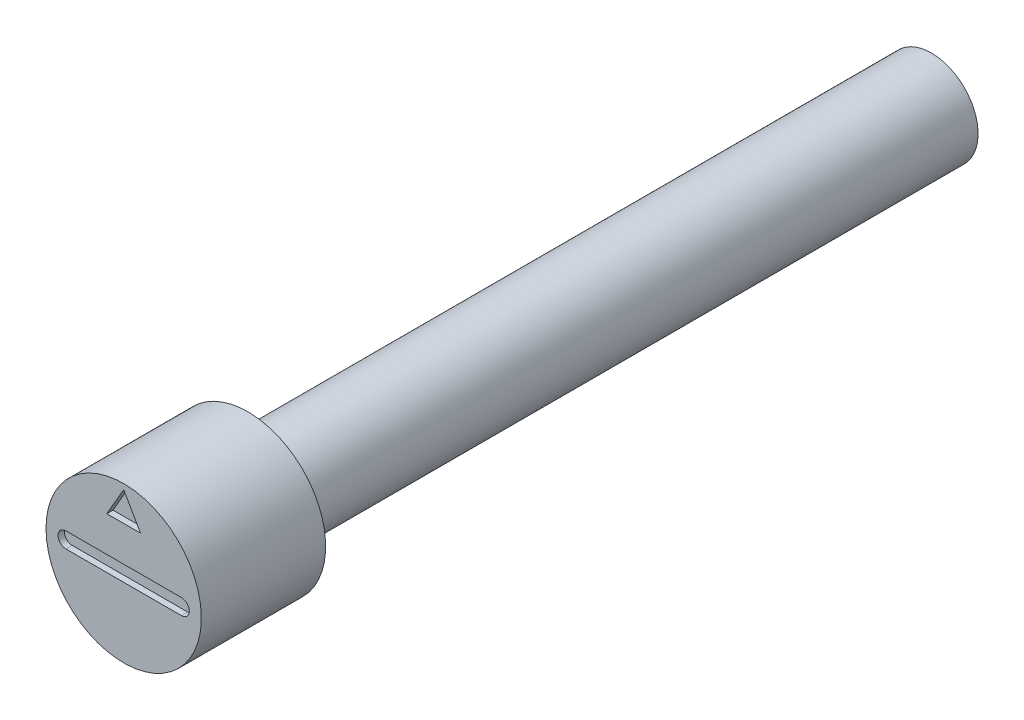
ISO-10303-21;
HEADER;
FILE_DESCRIPTION(('STEP AP214'),'2;1');
FILE_NAME('part.step','',(''),(''),'','','');
FILE_SCHEMA(('AUTOMOTIVE_DESIGN { 1 0 10303 214 1 1 1 1 }'));
ENDSEC;
DATA;
#1=APPLICATION_CONTEXT('core data for automotive mechanical design processes');
#2=APPLICATION_PROTOCOL_DEFINITION('international standard','automotive_design',2000,#1);
#3=PRODUCT_CONTEXT('',#1,'mechanical');
#4=PRODUCT('Part','Part','',(#3));
#5=PRODUCT_RELATED_PRODUCT_CATEGORY('part','',(#4));
#6=PRODUCT_DEFINITION_FORMATION('','',#4);
#7=PRODUCT_DEFINITION_CONTEXT('part definition',#1,'design');
#8=PRODUCT_DEFINITION('design','',#6,#7);
#9=PRODUCT_DEFINITION_SHAPE('','',#8);
#10=(LENGTH_UNIT() NAMED_UNIT(*) SI_UNIT(.MILLI.,.METRE.));
#11=(NAMED_UNIT(*) PLANE_ANGLE_UNIT() SI_UNIT($,.RADIAN.));
#12=(NAMED_UNIT(*) SI_UNIT($,.STERADIAN.) SOLID_ANGLE_UNIT());
#13=UNCERTAINTY_MEASURE_WITH_UNIT(LENGTH_MEASURE(1.E-05),#10,'distance_accuracy_value','');
#14=(GEOMETRIC_REPRESENTATION_CONTEXT(3) GLOBAL_UNCERTAINTY_ASSIGNED_CONTEXT((#13)) GLOBAL_UNIT_ASSIGNED_CONTEXT((#10,
#11,#12)) REPRESENTATION_CONTEXT('',''));
#15=CARTESIAN_POINT('',(0.,0.,0.));
#16=DIRECTION('',(0.,0.,1.));
#17=DIRECTION('',(1.,0.,0.));
#18=AXIS2_PLACEMENT_3D('',#15,#16,#17);
#19=CARTESIAN_POINT('',(0.62499875,0.,0.));
#20=DIRECTION('',(0.,0.,1.));
#21=DIRECTION('',(1.,0.,0.));
#22=AXIS2_PLACEMENT_3D('',#19,#20,#21);
#23=PLANE('',#22);
#24=CARTESIAN_POINT('',(-0.93,0.,0.));
#25=DIRECTION('',(0.,0.,1.));
#26=DIRECTION('',(1.,0.,0.));
#27=AXIS2_PLACEMENT_3D('',#24,#25,#26);
#28=CIRCLE('',#27,0.126);
#29=CARTESIAN_POINT('',(-0.93,0.126,0.));
#30=VERTEX_POINT('',#29);
#31=CARTESIAN_POINT('',(-0.93,-0.126,0.));
#32=VERTEX_POINT('',#31);
#33=EDGE_CURVE('E52',#30,#32,#28,.T.);
#34=ORIENTED_EDGE('',*,*,#33,.F.);
#35=DIRECTION('',(-1.,0.,0.));
#36=VECTOR('',#35,1.);
#37=CARTESIAN_POINT('',(-0.93,0.126,0.));
#38=LINE('',#37,#36);
#39=CARTESIAN_POINT('',(0.93,0.126,0.));
#40=VERTEX_POINT('',#39);
#41=EDGE_CURVE('E116',#40,#30,#38,.T.);
#42=ORIENTED_EDGE('',*,*,#41,.F.);
#43=CARTESIAN_POINT('',(0.93,0.,0.));
#44=DIRECTION('',(0.,0.,1.));
#45=DIRECTION('',(1.,0.,0.));
#46=AXIS2_PLACEMENT_3D('',#43,#44,#45);
#47=CIRCLE('',#46,0.126);
#48=CARTESIAN_POINT('',(0.93,-0.126,0.));
#49=VERTEX_POINT('',#48);
#50=EDGE_CURVE('E119',#49,#40,#47,.T.);
#51=ORIENTED_EDGE('',*,*,#50,.F.);
#52=DIRECTION('',(1.,0.,0.));
#53=VECTOR('',#52,1.);
#54=CARTESIAN_POINT('',(-0.93,-0.126,0.));
#55=LINE('',#54,#53);
#56=EDGE_CURVE('E125',#32,#49,#55,.T.);
#57=ORIENTED_EDGE('',*,*,#56,.F.);
#58=EDGE_LOOP('',(#34,#42,#51,#57));
#59=FACE_BOUND('',#58,.T.);
#60=DIRECTION('',(-0.499999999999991,0.866025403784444,0.));
#61=VECTOR('',#60,1.);
#62=CARTESIAN_POINT('',(0.271499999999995,0.6939,0.));
#63=LINE('',#62,#61);
#64=CARTESIAN_POINT('',(0.271499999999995,0.6939,0.));
#65=VERTEX_POINT('',#64);
#66=CARTESIAN_POINT('',(0.,1.16415179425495,0.));
#67=VERTEX_POINT('',#66);
#68=EDGE_CURVE('E60',#65,#67,#63,.T.);
#69=ORIENTED_EDGE('',*,*,#68,.F.);
#70=DIRECTION('',(1.,0.,0.));
#71=VECTOR('',#70,1.);
#72=CARTESIAN_POINT('',(-0.271500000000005,0.6939,0.));
#73=LINE('',#72,#71);
#74=CARTESIAN_POINT('',(-0.271500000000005,0.6939,0.));
#75=VERTEX_POINT('',#74);
#76=EDGE_CURVE('E138',#75,#65,#73,.T.);
#77=ORIENTED_EDGE('',*,*,#76,.F.);
#78=DIRECTION('',(-0.500000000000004,-0.866025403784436,0.));
#79=VECTOR('',#78,1.);
#80=CARTESIAN_POINT('',(0.,1.16415179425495,0.));
#81=LINE('',#80,#79);
#82=EDGE_CURVE('E146',#67,#75,#81,.T.);
#83=ORIENTED_EDGE('',*,*,#82,.F.);
#84=EDGE_LOOP('',(#69,#77,#83));
#85=FACE_BOUND('',#84,.T.);
#86=CARTESIAN_POINT('',(0.,0.,0.));
#87=DIRECTION('',(0.,0.,-1.));
#88=DIRECTION('',(-1.,0.,0.));
#89=AXIS2_PLACEMENT_3D('',#86,#87,#88);
#90=CIRCLE('',#89,1.2499975);
#91=CARTESIAN_POINT('',(-1.2499975,0.,0.));
#92=VERTEX_POINT('',#91);
#93=EDGE_CURVE('E39',#92,#92,#90,.T.);
#94=ORIENTED_EDGE('',*,*,#93,.F.);
#95=EDGE_LOOP('',(#94));
#96=FACE_BOUND('',#95,.T.);
#97=ADVANCED_FACE('F36',(#59,#85,#96),#23,.T.);
#98=CARTESIAN_POINT('',(0.,0.,-0.999998));
#99=DIRECTION('',(0.,0.,-1.));
#100=DIRECTION('',(-1.,0.,0.));
#101=AXIS2_PLACEMENT_3D('',#98,#99,#100);
#102=CYLINDRICAL_SURFACE('',#101,1.2499975);
#103=ORIENTED_EDGE('',*,*,#93,.T.);
#104=EDGE_LOOP('',(#103));
#105=FACE_BOUND('',#104,.T.);
#106=CARTESIAN_POINT('',(0.,0.,-1.999996));
#107=DIRECTION('',(0.,0.,-1.));
#108=DIRECTION('',(-1.,0.,0.));
#109=AXIS2_PLACEMENT_3D('',#106,#107,#108);
#110=CIRCLE('',#109,1.2499975);
#111=CARTESIAN_POINT('',(-1.2499975,0.,-1.999996));
#112=VERTEX_POINT('',#111);
#113=EDGE_CURVE('E157',#112,#112,#110,.T.);
#114=ORIENTED_EDGE('',*,*,#113,.F.);
#115=EDGE_LOOP('',(#114));
#116=FACE_BOUND('',#115,.T.);
#117=ADVANCED_FACE('F164',(#105,#116),#102,.T.);
#118=CARTESIAN_POINT('',(0.999998,0.,-1.999996));
#119=DIRECTION('',(0.,0.,-1.));
#120=DIRECTION('',(-1.,0.,0.));
#121=AXIS2_PLACEMENT_3D('',#118,#119,#120);
#122=PLANE('',#121);
#123=CARTESIAN_POINT('',(0.,0.,-1.999996));
#124=DIRECTION('',(0.,0.,-1.));
#125=DIRECTION('',(-1.,0.,0.));
#126=AXIS2_PLACEMENT_3D('',#123,#124,#125);
#127=CIRCLE('',#126,0.7499985);
#128=CARTESIAN_POINT('',(-0.749998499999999,0.,-1.999996));
#129=VERTEX_POINT('',#128);
#130=EDGE_CURVE('E44',#129,#129,#127,.T.);
#131=ORIENTED_EDGE('',*,*,#130,.F.);
#132=EDGE_LOOP('',(#131));
#133=FACE_BOUND('',#132,.T.);
#134=ORIENTED_EDGE('',*,*,#113,.T.);
#135=EDGE_LOOP('',(#134));
#136=FACE_BOUND('',#135,.T.);
#137=ADVANCED_FACE('F173',(#133,#136),#122,.T.);
#138=CARTESIAN_POINT('',(0.37499925,0.,-12.999974));
#139=DIRECTION('',(0.,0.,-1.));
#140=DIRECTION('',(-1.,0.,0.));
#141=AXIS2_PLACEMENT_3D('',#138,#139,#140);
#142=PLANE('',#141);
#143=CARTESIAN_POINT('',(0.,0.,-12.999974));
#144=DIRECTION('',(0.,0.,-1.));
#145=DIRECTION('',(-1.,0.,0.));
#146=AXIS2_PLACEMENT_3D('',#143,#144,#145);
#147=CIRCLE('',#146,0.7499985);
#148=CARTESIAN_POINT('',(-0.749998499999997,0.,-12.999974));
#149=VERTEX_POINT('',#148);
#150=EDGE_CURVE('E11',#149,#149,#147,.F.);
#151=ORIENTED_EDGE('',*,*,#150,.F.);
#152=EDGE_LOOP('',(#151));
#153=FACE_BOUND('',#152,.T.);
#154=ADVANCED_FACE('F180',(#153),#142,.T.);
#155=CARTESIAN_POINT('',(0.,0.,-7.499985));
#156=DIRECTION('',(0.,0.,-1.));
#157=DIRECTION('',(-1.,0.,0.));
#158=AXIS2_PLACEMENT_3D('',#155,#156,#157);
#159=CYLINDRICAL_SURFACE('',#158,0.7499985);
#160=ORIENTED_EDGE('',*,*,#130,.T.);
#161=EDGE_LOOP('',(#160));
#162=FACE_BOUND('',#161,.T.);
#163=ORIENTED_EDGE('',*,*,#150,.T.);
#164=EDGE_LOOP('',(#163));
#165=FACE_BOUND('',#164,.T.);
#166=ADVANCED_FACE('F177',(#162,#165),#159,.T.);
#167=CARTESIAN_POINT('',(0.271499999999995,0.6939,-0.1));
#168=DIRECTION('',(0.866025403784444,0.499999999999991,0.));
#169=DIRECTION('',(-0.499999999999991,0.866025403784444,0.));
#170=AXIS2_PLACEMENT_3D('',#167,#168,#169);
#171=PLANE('',#170);
#172=ORIENTED_EDGE('',*,*,#68,.T.);
#173=DIRECTION('',(0.,0.,1.));
#174=VECTOR('',#173,1.);
#175=CARTESIAN_POINT('',(0.,1.16415179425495,-0.1));
#176=LINE('',#175,#174);
#177=CARTESIAN_POINT('',(0.,1.16415179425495,-0.1));
#178=VERTEX_POINT('',#177);
#179=EDGE_CURVE('E144',#178,#67,#176,.T.);
#180=ORIENTED_EDGE('',*,*,#179,.F.);
#181=DIRECTION('',(-0.499999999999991,0.866025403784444,0.));
#182=VECTOR('',#181,1.);
#183=CARTESIAN_POINT('',(0.271499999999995,0.6939,-0.1));
#184=LINE('',#183,#182);
#185=CARTESIAN_POINT('',(0.271499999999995,0.6939,-0.1));
#186=VERTEX_POINT('',#185);
#187=EDGE_CURVE('E134',#186,#178,#184,.T.);
#188=ORIENTED_EDGE('',*,*,#187,.F.);
#189=DIRECTION('',(0.,0.,1.));
#190=VECTOR('',#189,1.);
#191=CARTESIAN_POINT('',(0.271499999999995,0.6939,-0.1));
#192=LINE('',#191,#190);
#193=EDGE_CURVE('E151',#186,#65,#192,.T.);
#194=ORIENTED_EDGE('',*,*,#193,.T.);
#195=EDGE_LOOP('',(#172,#180,#188,#194));
#196=FACE_BOUND('',#195,.T.);
#197=ADVANCED_FACE('F169',(#196),#171,.F.);
#198=CARTESIAN_POINT('',(-0.271500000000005,0.6939,-0.1));
#199=DIRECTION('',(0.,-1.,0.));
#200=DIRECTION('',(1.,0.,0.));
#201=AXIS2_PLACEMENT_3D('',#198,#199,#200);
#202=PLANE('',#201);
#203=ORIENTED_EDGE('',*,*,#76,.T.);
#204=ORIENTED_EDGE('',*,*,#193,.F.);
#205=DIRECTION('',(1.,0.,0.));
#206=VECTOR('',#205,1.);
#207=CARTESIAN_POINT('',(-0.271500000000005,0.6939,-0.1));
#208=LINE('',#207,#206);
#209=CARTESIAN_POINT('',(-0.271500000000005,0.6939,-0.1));
#210=VERTEX_POINT('',#209);
#211=EDGE_CURVE('E141',#210,#186,#208,.T.);
#212=ORIENTED_EDGE('',*,*,#211,.F.);
#213=DIRECTION('',(0.,0.,1.));
#214=VECTOR('',#213,1.);
#215=CARTESIAN_POINT('',(-0.271500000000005,0.6939,-0.1));
#216=LINE('',#215,#214);
#217=EDGE_CURVE('E153',#210,#75,#216,.T.);
#218=ORIENTED_EDGE('',*,*,#217,.T.);
#219=EDGE_LOOP('',(#203,#204,#212,#218));
#220=FACE_BOUND('',#219,.T.);
#221=ADVANCED_FACE('F176',(#220),#202,.F.);
#222=CARTESIAN_POINT('',(0.,1.16415179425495,-0.1));
#223=DIRECTION('',(-0.866025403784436,0.500000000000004,0.));
#224=DIRECTION('',(-0.500000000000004,-0.866025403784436,0.));
#225=AXIS2_PLACEMENT_3D('',#222,#223,#224);
#226=PLANE('',#225);
#227=ORIENTED_EDGE('',*,*,#82,.T.);
#228=ORIENTED_EDGE('',*,*,#217,.F.);
#229=DIRECTION('',(-0.500000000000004,-0.866025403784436,0.));
#230=VECTOR('',#229,1.);
#231=CARTESIAN_POINT('',(0.,1.16415179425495,-0.1));
#232=LINE('',#231,#230);
#233=EDGE_CURVE('E137',#178,#210,#232,.T.);
#234=ORIENTED_EDGE('',*,*,#233,.F.);
#235=ORIENTED_EDGE('',*,*,#179,.T.);
#236=EDGE_LOOP('',(#227,#228,#234,#235));
#237=FACE_BOUND('',#236,.T.);
#238=ADVANCED_FACE('F232',(#237),#226,.F.);
#239=CARTESIAN_POINT('',(0.,0.,-0.1));
#240=DIRECTION('',(0.,0.,1.));
#241=DIRECTION('',(1.,0.,0.));
#242=AXIS2_PLACEMENT_3D('',#239,#240,#241);
#243=PLANE('',#242);
#244=ORIENTED_EDGE('',*,*,#187,.T.);
#245=ORIENTED_EDGE('',*,*,#233,.T.);
#246=ORIENTED_EDGE('',*,*,#211,.T.);
#247=EDGE_LOOP('',(#244,#245,#246));
#248=FACE_BOUND('',#247,.T.);
#249=ADVANCED_FACE('F243',(#248),#243,.T.);
#250=CARTESIAN_POINT('',(-0.93,0.,-0.1));
#251=DIRECTION('',(0.,0.,1.));
#252=DIRECTION('',(1.,0.,0.));
#253=AXIS2_PLACEMENT_3D('',#250,#251,#252);
#254=CYLINDRICAL_SURFACE('',#253,0.126);
#255=ORIENTED_EDGE('',*,*,#33,.T.);
#256=DIRECTION('',(0.,0.,1.));
#257=VECTOR('',#256,1.);
#258=CARTESIAN_POINT('',(-0.93,-0.126,-0.1));
#259=LINE('',#258,#257);
#260=CARTESIAN_POINT('',(-0.93,-0.126,-0.1));
#261=VERTEX_POINT('',#260);
#262=EDGE_CURVE('E94',#261,#32,#259,.T.);
#263=ORIENTED_EDGE('',*,*,#262,.F.);
#264=CARTESIAN_POINT('',(-0.93,0.,-0.1));
#265=DIRECTION('',(0.,0.,1.));
#266=DIRECTION('',(1.,0.,0.));
#267=AXIS2_PLACEMENT_3D('',#264,#265,#266);
#268=CIRCLE('',#267,0.126);
#269=CARTESIAN_POINT('',(-0.93,0.126,-0.1));
#270=VERTEX_POINT('',#269);
#271=EDGE_CURVE('E98',#270,#261,#268,.T.);
#272=ORIENTED_EDGE('',*,*,#271,.F.);
#273=DIRECTION('',(0.,0.,1.));
#274=VECTOR('',#273,1.);
#275=CARTESIAN_POINT('',(-0.93,0.126,-0.1));
#276=LINE('',#275,#274);
#277=EDGE_CURVE('E129',#270,#30,#276,.T.);
#278=ORIENTED_EDGE('',*,*,#277,.T.);
#279=EDGE_LOOP('',(#255,#263,#272,#278));
#280=FACE_BOUND('',#279,.T.);
#281=ADVANCED_FACE('F96',(#280),#254,.F.);
#282=CARTESIAN_POINT('',(-0.93,0.126,-0.1));
#283=DIRECTION('',(0.,1.,0.));
#284=DIRECTION('',(0.,0.,1.));
#285=AXIS2_PLACEMENT_3D('',#282,#283,#284);
#286=PLANE('',#285);
#287=ORIENTED_EDGE('',*,*,#41,.T.);
#288=ORIENTED_EDGE('',*,*,#277,.F.);
#289=DIRECTION('',(-1.,0.,0.));
#290=VECTOR('',#289,1.);
#291=CARTESIAN_POINT('',(-0.93,0.126,-0.1));
#292=LINE('',#291,#290);
#293=CARTESIAN_POINT('',(0.93,0.126,-0.1));
#294=VERTEX_POINT('',#293);
#295=EDGE_CURVE('E104',#294,#270,#292,.T.);
#296=ORIENTED_EDGE('',*,*,#295,.F.);
#297=DIRECTION('',(0.,0.,1.));
#298=VECTOR('',#297,1.);
#299=CARTESIAN_POINT('',(0.93,0.126,-0.1));
#300=LINE('',#299,#298);
#301=EDGE_CURVE('E131',#294,#40,#300,.T.);
#302=ORIENTED_EDGE('',*,*,#301,.T.);
#303=EDGE_LOOP('',(#287,#288,#296,#302));
#304=FACE_BOUND('',#303,.T.);
#305=ADVANCED_FACE('F263',(#304),#286,.F.);
#306=CARTESIAN_POINT('',(0.93,0.,-0.1));
#307=DIRECTION('',(0.,0.,1.));
#308=DIRECTION('',(1.,0.,0.));
#309=AXIS2_PLACEMENT_3D('',#306,#307,#308);
#310=CYLINDRICAL_SURFACE('',#309,0.126);
#311=ORIENTED_EDGE('',*,*,#50,.T.);
#312=ORIENTED_EDGE('',*,*,#301,.F.);
#313=CARTESIAN_POINT('',(0.93,0.,-0.1));
#314=DIRECTION('',(0.,0.,1.));
#315=DIRECTION('',(1.,0.,0.));
#316=AXIS2_PLACEMENT_3D('',#313,#314,#315);
#317=CIRCLE('',#316,0.126);
#318=CARTESIAN_POINT('',(0.93,-0.126,-0.1));
#319=VERTEX_POINT('',#318);
#320=EDGE_CURVE('E112',#319,#294,#317,.T.);
#321=ORIENTED_EDGE('',*,*,#320,.F.);
#322=DIRECTION('',(0.,0.,1.));
#323=VECTOR('',#322,1.);
#324=CARTESIAN_POINT('',(0.93,-0.126,-0.1));
#325=LINE('',#324,#323);
#326=EDGE_CURVE('E103',#319,#49,#325,.T.);
#327=ORIENTED_EDGE('',*,*,#326,.T.);
#328=EDGE_LOOP('',(#311,#312,#321,#327));
#329=FACE_BOUND('',#328,.T.);
#330=ADVANCED_FACE('F273',(#329),#310,.F.);
#331=CARTESIAN_POINT('',(-0.93,-0.126,-0.1));
#332=DIRECTION('',(0.,-1.,0.));
#333=DIRECTION('',(0.,0.,-1.));
#334=AXIS2_PLACEMENT_3D('',#331,#332,#333);
#335=PLANE('',#334);
#336=ORIENTED_EDGE('',*,*,#56,.T.);
#337=ORIENTED_EDGE('',*,*,#326,.F.);
#338=DIRECTION('',(1.,0.,0.));
#339=VECTOR('',#338,1.);
#340=CARTESIAN_POINT('',(-0.93,-0.126,-0.1));
#341=LINE('',#340,#339);
#342=EDGE_CURVE('E107',#261,#319,#341,.T.);
#343=ORIENTED_EDGE('',*,*,#342,.F.);
#344=ORIENTED_EDGE('',*,*,#262,.T.);
#345=EDGE_LOOP('',(#336,#337,#343,#344));
#346=FACE_BOUND('',#345,.T.);
#347=ADVANCED_FACE('F108',(#346),#335,.F.);
#348=CARTESIAN_POINT('',(-0.93,0.,-0.1));
#349=DIRECTION('',(0.,0.,1.));
#350=DIRECTION('',(1.,0.,0.));
#351=AXIS2_PLACEMENT_3D('',#348,#349,#350);
#352=PLANE('',#351);
#353=ORIENTED_EDGE('',*,*,#271,.T.);
#354=ORIENTED_EDGE('',*,*,#342,.T.);
#355=ORIENTED_EDGE('',*,*,#320,.T.);
#356=ORIENTED_EDGE('',*,*,#295,.T.);
#357=EDGE_LOOP('',(#353,#354,#355,#356));
#358=FACE_BOUND('',#357,.T.);
#359=ADVANCED_FACE('F114',(#358),#352,.T.);
#360=CLOSED_SHELL('',(#97,#117,#137,#154,#166,#197,#221,#238,#249,#281,#305,#330,#347,#359));
#361=MANIFOLD_SOLID_BREP('B2',#360);
#362=ADVANCED_BREP_SHAPE_REPRESENTATION('',(#18,#361),#14);
#363=SHAPE_DEFINITION_REPRESENTATION(#9,#362);
ENDSEC;
END-ISO-10303-21;
